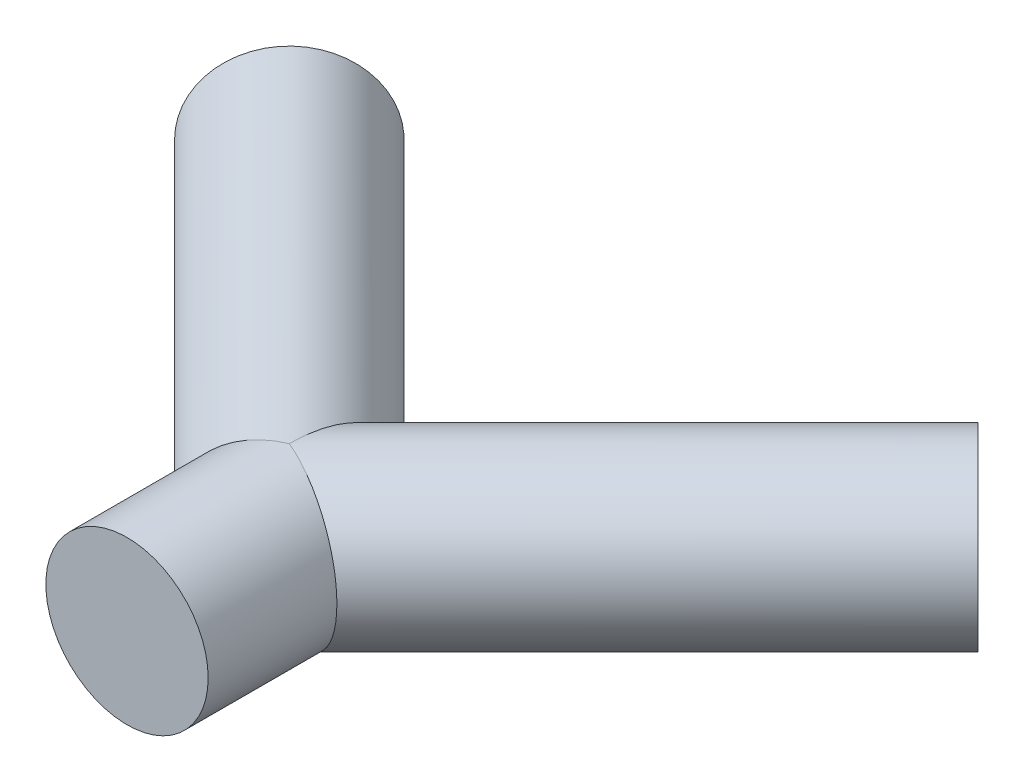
ISO-10303-21;
HEADER;
FILE_DESCRIPTION(('STEP AP214'),'2;1');
FILE_NAME('part.step','',(''),(''),'','','');
FILE_SCHEMA(('AUTOMOTIVE_DESIGN { 1 0 10303 214 1 1 1 1 }'));
ENDSEC;
DATA;
#1=APPLICATION_CONTEXT('core data for automotive mechanical design processes');
#2=APPLICATION_PROTOCOL_DEFINITION('international standard','automotive_design',2000,#1);
#3=PRODUCT_CONTEXT('',#1,'mechanical');
#4=PRODUCT('Part','Part','',(#3));
#5=PRODUCT_RELATED_PRODUCT_CATEGORY('part','',(#4));
#6=PRODUCT_DEFINITION_FORMATION('','',#4);
#7=PRODUCT_DEFINITION_CONTEXT('part definition',#1,'design');
#8=PRODUCT_DEFINITION('design','',#6,#7);
#9=PRODUCT_DEFINITION_SHAPE('','',#8);
#10=(LENGTH_UNIT() NAMED_UNIT(*) SI_UNIT(.MILLI.,.METRE.));
#11=(NAMED_UNIT(*) PLANE_ANGLE_UNIT() SI_UNIT($,.RADIAN.));
#12=(NAMED_UNIT(*) SI_UNIT($,.STERADIAN.) SOLID_ANGLE_UNIT());
#13=UNCERTAINTY_MEASURE_WITH_UNIT(LENGTH_MEASURE(1.E-05),#10,'distance_accuracy_value','');
#14=(GEOMETRIC_REPRESENTATION_CONTEXT(3) GLOBAL_UNCERTAINTY_ASSIGNED_CONTEXT((#13)) GLOBAL_UNIT_ASSIGNED_CONTEXT((#10,
#11,#12)) REPRESENTATION_CONTEXT('',''));
#15=CARTESIAN_POINT('',(0.,0.,0.));
#16=DIRECTION('',(0.,0.,1.));
#17=DIRECTION('',(1.,0.,0.));
#18=AXIS2_PLACEMENT_3D('',#15,#16,#17);
#19=CARTESIAN_POINT('',(0.,0.,-43.3605122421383));
#20=DIRECTION('',(0.,0.,1.));
#21=DIRECTION('',(1.,0.,0.));
#22=AXIS2_PLACEMENT_3D('',#19,#20,#21);
#23=CYLINDRICAL_SURFACE('',#22,6.35);
#24=CARTESIAN_POINT('',(0.,0.,-25.4));
#25=DIRECTION('',(0.382683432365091,0.,-0.923879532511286));
#26=DIRECTION('',(0.923879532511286,0.,0.382683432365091));
#27=AXIS2_PLACEMENT_3D('',#24,#25,#26);
#28=ELLIPSE('',#27,6.8731904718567,6.35);
#29=CARTESIAN_POINT('',(0.,-6.35,-25.4));
#30=VERTEX_POINT('',#29);
#31=CARTESIAN_POINT('',(0.,6.35,-25.4));
#32=VERTEX_POINT('',#31);
#33=EDGE_CURVE('E57',#30,#32,#28,.F.);
#34=ORIENTED_EDGE('',*,*,#33,.T.);
#35=CARTESIAN_POINT('',(0.,0.,-25.4));
#36=DIRECTION('',(0.38268343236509,0.,0.923879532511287));
#37=DIRECTION('',(-0.923879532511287,0.,0.38268343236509));
#38=AXIS2_PLACEMENT_3D('',#35,#36,#37);
#39=ELLIPSE('',#38,6.8731904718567,6.35);
#40=EDGE_CURVE('E12',#32,#30,#39,.T.);
#41=ORIENTED_EDGE('',*,*,#40,.T.);
#42=EDGE_LOOP('',(#34,#41));
#43=FACE_BOUND('',#42,.T.);
#44=CARTESIAN_POINT('',(0.,0.,-12.7));
#45=DIRECTION('',(0.,0.,1.));
#46=DIRECTION('',(1.,0.,0.));
#47=AXIS2_PLACEMENT_3D('',#44,#45,#46);
#48=CIRCLE('',#47,6.35);
#49=CARTESIAN_POINT('',(6.35,0.,-12.7));
#50=VERTEX_POINT('',#49);
#51=EDGE_CURVE('E66',#50,#50,#48,.T.);
#52=ORIENTED_EDGE('',*,*,#51,.F.);
#53=EDGE_LOOP('',(#52));
#54=FACE_BOUND('',#53,.T.);
#55=ADVANCED_FACE('F37',(#43,#54),#23,.T.);
#56=CARTESIAN_POINT('',(0.,0.,-25.4));
#57=DIRECTION('',(0.707106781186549,0.,-0.707106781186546));
#58=DIRECTION('',(-0.707106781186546,0.,-0.707106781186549));
#59=AXIS2_PLACEMENT_3D('',#56,#57,#58);
#60=CYLINDRICAL_SURFACE('',#59,6.35);
#61=CARTESIAN_POINT('',(26.9407683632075,0.,-52.3407683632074));
#62=DIRECTION('',(0.707106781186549,0.,-0.707106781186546));
#63=DIRECTION('',(-0.707106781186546,0.,-0.707106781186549));
#64=AXIS2_PLACEMENT_3D('',#61,#62,#63);
#65=CIRCLE('',#64,6.35);
#66=CARTESIAN_POINT('',(22.4506403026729,0.,-56.830896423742));
#67=VERTEX_POINT('',#66);
#68=EDGE_CURVE('E45',#67,#67,#65,.T.);
#69=ORIENTED_EDGE('',*,*,#68,.F.);
#70=EDGE_LOOP('',(#69));
#71=FACE_BOUND('',#70,.T.);
#72=CARTESIAN_POINT('',(0.,0.,-25.4));
#73=DIRECTION('',(1.,0.,0.));
#74=DIRECTION('',(0.,0.,-1.));
#75=AXIS2_PLACEMENT_3D('',#72,#73,#74);
#76=ELLIPSE('',#75,8.98025612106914,6.35);
#77=EDGE_CURVE('E51',#32,#30,#76,.F.);
#78=ORIENTED_EDGE('',*,*,#77,.F.);
#79=ORIENTED_EDGE('',*,*,#33,.F.);
#80=EDGE_LOOP('',(#78,#79));
#81=FACE_BOUND('',#80,.T.);
#82=ADVANCED_FACE('F39',(#71,#81),#60,.T.);
#83=CARTESIAN_POINT('',(26.9407683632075,0.,-52.3407683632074));
#84=DIRECTION('',(0.707106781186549,0.,-0.707106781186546));
#85=DIRECTION('',(-0.707106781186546,0.,-0.707106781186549));
#86=AXIS2_PLACEMENT_3D('',#83,#84,#85);
#87=PLANE('',#86);
#88=ORIENTED_EDGE('',*,*,#68,.T.);
#89=EDGE_LOOP('',(#88));
#90=FACE_BOUND('',#89,.T.);
#91=ADVANCED_FACE('F75',(#90),#87,.T.);
#92=CARTESIAN_POINT('',(0.,0.,-25.4));
#93=DIRECTION('',(-0.707106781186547,0.,-0.707106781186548));
#94=DIRECTION('',(-0.707106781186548,0.,0.707106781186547));
#95=AXIS2_PLACEMENT_3D('',#92,#93,#94);
#96=CYLINDRICAL_SURFACE('',#95,6.35);
#97=CARTESIAN_POINT('',(-26.9407683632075,0.,-52.3407683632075));
#98=DIRECTION('',(-0.707106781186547,0.,-0.707106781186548));
#99=DIRECTION('',(-0.707106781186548,0.,0.707106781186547));
#100=AXIS2_PLACEMENT_3D('',#97,#98,#99);
#101=CIRCLE('',#100,6.35);
#102=CARTESIAN_POINT('',(-31.430896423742,0.,-47.8506403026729));
#103=VERTEX_POINT('',#102);
#104=EDGE_CURVE('E58',#103,#103,#101,.T.);
#105=ORIENTED_EDGE('',*,*,#104,.F.);
#106=EDGE_LOOP('',(#105));
#107=FACE_BOUND('',#106,.T.);
#108=ORIENTED_EDGE('',*,*,#40,.F.);
#109=ORIENTED_EDGE('',*,*,#77,.T.);
#110=EDGE_LOOP('',(#108,#109));
#111=FACE_BOUND('',#110,.T.);
#112=ADVANCED_FACE('F52',(#107,#111),#96,.T.);
#113=CARTESIAN_POINT('',(-26.9407683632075,0.,-52.3407683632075));
#114=DIRECTION('',(-0.707106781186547,0.,-0.707106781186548));
#115=DIRECTION('',(-0.707106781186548,0.,0.707106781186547));
#116=AXIS2_PLACEMENT_3D('',#113,#114,#115);
#117=PLANE('',#116);
#118=ORIENTED_EDGE('',*,*,#104,.T.);
#119=EDGE_LOOP('',(#118));
#120=FACE_BOUND('',#119,.T.);
#121=ADVANCED_FACE('F83',(#120),#117,.T.);
#122=CARTESIAN_POINT('',(0.,0.,-12.7));
#123=DIRECTION('',(0.,0.,1.));
#124=DIRECTION('',(1.,0.,0.));
#125=AXIS2_PLACEMENT_3D('',#122,#123,#124);
#126=PLANE('',#125);
#127=ORIENTED_EDGE('',*,*,#51,.T.);
#128=EDGE_LOOP('',(#127));
#129=FACE_BOUND('',#128,.T.);
#130=ADVANCED_FACE('F70',(#129),#126,.T.);
#131=CLOSED_SHELL('',(#55,#82,#91,#112,#121,#130));
#132=MANIFOLD_SOLID_BREP('B2',#131);
#133=ADVANCED_BREP_SHAPE_REPRESENTATION('',(#18,#132),#14);
#134=SHAPE_DEFINITION_REPRESENTATION(#9,#133);
ENDSEC;
END-ISO-10303-21;
